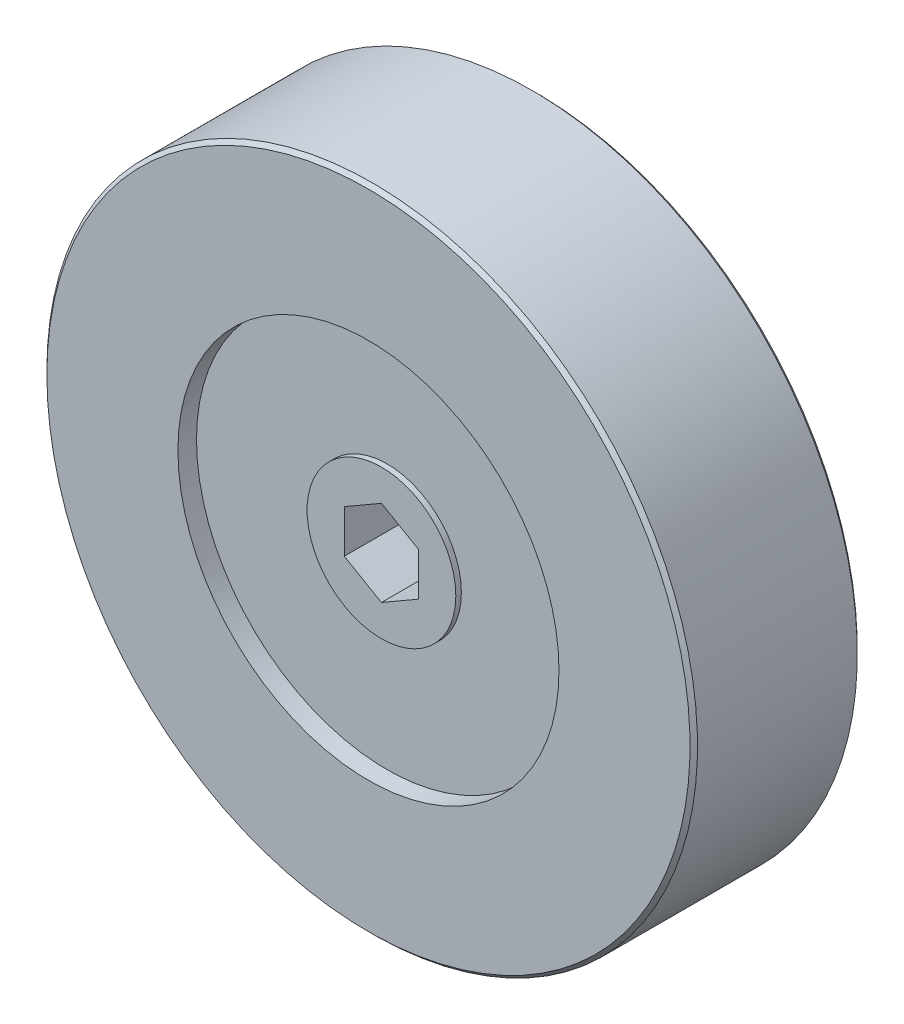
ISO-10303-21;
HEADER;
FILE_DESCRIPTION(('STEP AP214'),'2;1');
FILE_NAME('part.step','',(''),(''),'','','');
FILE_SCHEMA(('AUTOMOTIVE_DESIGN { 1 0 10303 214 1 1 1 1 }'));
ENDSEC;
DATA;
#1=APPLICATION_CONTEXT('core data for automotive mechanical design processes');
#2=APPLICATION_PROTOCOL_DEFINITION('international standard','automotive_design',2000,#1);
#3=PRODUCT_CONTEXT('',#1,'mechanical');
#4=PRODUCT('Part','Part','',(#3));
#5=PRODUCT_RELATED_PRODUCT_CATEGORY('part','',(#4));
#6=PRODUCT_DEFINITION_FORMATION('','',#4);
#7=PRODUCT_DEFINITION_CONTEXT('part definition',#1,'design');
#8=PRODUCT_DEFINITION('design','',#6,#7);
#9=PRODUCT_DEFINITION_SHAPE('','',#8);
#10=(LENGTH_UNIT() NAMED_UNIT(*) SI_UNIT(.MILLI.,.METRE.));
#11=(NAMED_UNIT(*) PLANE_ANGLE_UNIT() SI_UNIT($,.RADIAN.));
#12=(NAMED_UNIT(*) SI_UNIT($,.STERADIAN.) SOLID_ANGLE_UNIT());
#13=UNCERTAINTY_MEASURE_WITH_UNIT(LENGTH_MEASURE(1.E-05),#10,'distance_accuracy_value','');
#14=(GEOMETRIC_REPRESENTATION_CONTEXT(3) GLOBAL_UNCERTAINTY_ASSIGNED_CONTEXT((#13)) GLOBAL_UNIT_ASSIGNED_CONTEXT((#10,
#11,#12)) REPRESENTATION_CONTEXT('',''));
#15=CARTESIAN_POINT('',(0.,0.,0.));
#16=DIRECTION('',(0.,0.,1.));
#17=DIRECTION('',(1.,0.,0.));
#18=AXIS2_PLACEMENT_3D('',#15,#16,#17);
#19=CARTESIAN_POINT('',(0.,0.,1.2));
#20=DIRECTION('',(0.,0.,-1.));
#21=DIRECTION('',(-1.,0.,0.));
#22=AXIS2_PLACEMENT_3D('',#19,#20,#21);
#23=CYLINDRICAL_SURFACE('',#22,2.5);
#24=CARTESIAN_POINT('',(0.,0.,-7.1));
#25=DIRECTION('',(0.,0.,-1.));
#26=DIRECTION('',(-1.,0.,0.));
#27=AXIS2_PLACEMENT_3D('',#24,#25,#26);
#28=CIRCLE('',#27,2.5);
#29=CARTESIAN_POINT('',(-2.5,0.,-7.1));
#30=VERTEX_POINT('',#29);
#31=EDGE_CURVE('E9',#30,#30,#28,.F.);
#32=ORIENTED_EDGE('',*,*,#31,.T.);
#33=EDGE_LOOP('',(#32));
#34=FACE_BOUND('',#33,.T.);
#35=CARTESIAN_POINT('',(0.,0.,-1.1));
#36=DIRECTION('',(0.,0.,1.));
#37=DIRECTION('',(1.,0.,0.));
#38=AXIS2_PLACEMENT_3D('',#35,#36,#37);
#39=CIRCLE('',#38,2.5);
#40=CARTESIAN_POINT('',(2.5,0.,-1.1));
#41=VERTEX_POINT('',#40);
#42=EDGE_CURVE('E76',#41,#41,#39,.T.);
#43=ORIENTED_EDGE('',*,*,#42,.F.);
#44=EDGE_LOOP('',(#43));
#45=FACE_BOUND('',#44,.T.);
#46=ADVANCED_FACE('F14',(#34,#45),#23,.T.);
#47=CARTESIAN_POINT('',(0.,0.,1.2));
#48=DIRECTION('',(0.,0.,-1.));
#49=DIRECTION('',(-1.,0.,0.));
#50=AXIS2_PLACEMENT_3D('',#47,#48,#49);
#51=CYLINDRICAL_SURFACE('',#50,5.);
#52=CARTESIAN_POINT('',(0.,0.,2.));
#53=DIRECTION('',(0.,0.,-1.));
#54=DIRECTION('',(-1.,0.,0.));
#55=AXIS2_PLACEMENT_3D('',#52,#53,#54);
#56=CIRCLE('',#55,5.);
#57=CARTESIAN_POINT('',(-5.,0.,2.));
#58=VERTEX_POINT('',#57);
#59=EDGE_CURVE('E113',#58,#58,#56,.F.);
#60=ORIENTED_EDGE('',*,*,#59,.F.);
#61=EDGE_LOOP('',(#60));
#62=FACE_BOUND('',#61,.T.);
#63=CARTESIAN_POINT('',(0.,0.,0.5));
#64=DIRECTION('',(0.,0.,-1.));
#65=DIRECTION('',(-1.,0.,0.));
#66=AXIS2_PLACEMENT_3D('',#63,#64,#65);
#67=CIRCLE('',#66,5.);
#68=CARTESIAN_POINT('',(-5.,0.,0.5));
#69=VERTEX_POINT('',#68);
#70=EDGE_CURVE('E110',#69,#69,#67,.T.);
#71=ORIENTED_EDGE('',*,*,#70,.F.);
#72=EDGE_LOOP('',(#71));
#73=FACE_BOUND('',#72,.T.);
#74=ADVANCED_FACE('F155',(#62,#73),#51,.T.);
#75=CARTESIAN_POINT('',(0.,5.1,2.));
#76=DIRECTION('',(0.,0.,-1.));
#77=DIRECTION('',(-1.,0.,0.));
#78=AXIS2_PLACEMENT_3D('',#75,#76,#77);
#79=PLANE('',#78);
#80=CARTESIAN_POINT('',(0.,0.,2.));
#81=DIRECTION('',(0.,0.,1.));
#82=DIRECTION('',(1.,0.,0.));
#83=AXIS2_PLACEMENT_3D('',#80,#81,#82);
#84=CIRCLE('',#83,10.25);
#85=CARTESIAN_POINT('',(10.25,0.,2.));
#86=VERTEX_POINT('',#85);
#87=EDGE_CURVE('E128',#86,#86,#84,.T.);
#88=ORIENTED_EDGE('',*,*,#87,.F.);
#89=EDGE_LOOP('',(#88));
#90=FACE_BOUND('',#89,.T.);
#91=ORIENTED_EDGE('',*,*,#59,.T.);
#92=EDGE_LOOP('',(#91));
#93=FACE_BOUND('',#92,.T.);
#94=ADVANCED_FACE('F161',(#90,#93),#79,.T.);
#95=CARTESIAN_POINT('',(0.,0.,13.));
#96=DIRECTION('',(0.,0.,1.));
#97=DIRECTION('',(1.,0.,0.));
#98=AXIS2_PLACEMENT_3D('',#95,#96,#97);
#99=CYLINDRICAL_SURFACE('',#98,10.25);
#100=ORIENTED_EDGE('',*,*,#87,.T.);
#101=EDGE_LOOP('',(#100));
#102=FACE_BOUND('',#101,.T.);
#103=CARTESIAN_POINT('',(0.,0.,1.));
#104=DIRECTION('',(0.,0.,1.));
#105=DIRECTION('',(1.,0.,0.));
#106=AXIS2_PLACEMENT_3D('',#103,#104,#105);
#107=CIRCLE('',#106,10.25);
#108=CARTESIAN_POINT('',(10.25,0.,1.));
#109=VERTEX_POINT('',#108);
#110=EDGE_CURVE('E131',#109,#109,#107,.T.);
#111=ORIENTED_EDGE('',*,*,#110,.F.);
#112=EDGE_LOOP('',(#111));
#113=FACE_BOUND('',#112,.T.);
#114=ADVANCED_FACE('F196',(#102,#113),#99,.F.);
#115=CARTESIAN_POINT('',(0.,14.8,1.));
#116=DIRECTION('',(0.,0.,-1.));
#117=DIRECTION('',(-1.,0.,0.));
#118=AXIS2_PLACEMENT_3D('',#115,#116,#117);
#119=PLANE('',#118);
#120=CARTESIAN_POINT('',(0.,0.,1.));
#121=DIRECTION('',(0.,0.,-1.));
#122=DIRECTION('',(-1.,0.,0.));
#123=AXIS2_PLACEMENT_3D('',#120,#121,#122);
#124=CIRCLE('',#123,17.3);
#125=CARTESIAN_POINT('',(-17.3,0.,1.));
#126=VERTEX_POINT('',#125);
#127=EDGE_CURVE('E430',#126,#126,#124,.T.);
#128=ORIENTED_EDGE('',*,*,#127,.T.);
#129=EDGE_LOOP('',(#128));
#130=FACE_BOUND('',#129,.T.);
#131=ORIENTED_EDGE('',*,*,#110,.T.);
#132=EDGE_LOOP('',(#131));
#133=FACE_BOUND('',#132,.T.);
#134=ADVANCED_FACE('F200',(#130,#133),#119,.T.);
#135=CARTESIAN_POINT('',(0.,0.,0.5));
#136=DIRECTION('',(0.,0.,-1.));
#137=DIRECTION('',(-1.,0.,0.));
#138=AXIS2_PLACEMENT_3D('',#135,#136,#137);
#139=PLANE('',#138);
#140=CARTESIAN_POINT('',(0.,0.,0.5));
#141=DIRECTION('',(0.,0.,-1.));
#142=DIRECTION('',(-1.,0.,0.));
#143=AXIS2_PLACEMENT_3D('',#140,#141,#142);
#144=CIRCLE('',#143,2.);
#145=CARTESIAN_POINT('',(-2.,0.,0.5));
#146=VERTEX_POINT('',#145);
#147=EDGE_CURVE('E107',#146,#146,#144,.T.);
#148=ORIENTED_EDGE('',*,*,#147,.F.);
#149=EDGE_LOOP('',(#148));
#150=FACE_BOUND('',#149,.T.);
#151=ORIENTED_EDGE('',*,*,#70,.T.);
#152=EDGE_LOOP('',(#151));
#153=FACE_BOUND('',#152,.T.);
#154=ADVANCED_FACE('F170',(#150,#153),#139,.T.);
#155=CARTESIAN_POINT('',(0.,0.,1.2));
#156=DIRECTION('',(0.,0.,-1.));
#157=DIRECTION('',(-1.,0.,0.));
#158=AXIS2_PLACEMENT_3D('',#155,#156,#157);
#159=CYLINDRICAL_SURFACE('',#158,2.);
#160=CARTESIAN_POINT('',(0.,0.,-1.1));
#161=DIRECTION('',(0.,0.,1.));
#162=DIRECTION('',(1.,0.,0.));
#163=AXIS2_PLACEMENT_3D('',#160,#161,#162);
#164=CIRCLE('',#163,2.);
#165=CARTESIAN_POINT('',(2.,0.,-1.1));
#166=VERTEX_POINT('',#165);
#167=EDGE_CURVE('E106',#166,#166,#164,.T.);
#168=ORIENTED_EDGE('',*,*,#167,.T.);
#169=EDGE_LOOP('',(#168));
#170=FACE_BOUND('',#169,.T.);
#171=ORIENTED_EDGE('',*,*,#147,.T.);
#172=EDGE_LOOP('',(#171));
#173=FACE_BOUND('',#172,.T.);
#174=ADVANCED_FACE('F167',(#170,#173),#159,.T.);
#175=CARTESIAN_POINT('',(0.,0.,-1.1));
#176=DIRECTION('',(0.,0.,1.));
#177=DIRECTION('',(1.,0.,0.));
#178=AXIS2_PLACEMENT_3D('',#175,#176,#177);
#179=PLANE('',#178);
#180=ORIENTED_EDGE('',*,*,#167,.F.);
#181=EDGE_LOOP('',(#180));
#182=FACE_BOUND('',#181,.T.);
#183=ORIENTED_EDGE('',*,*,#42,.T.);
#184=EDGE_LOOP('',(#183));
#185=FACE_BOUND('',#184,.T.);
#186=ADVANCED_FACE('F151',(#182,#185),#179,.T.);
#187=CARTESIAN_POINT('',(0.,0.,-7.5));
#188=DIRECTION('',(0.,0.,-1.));
#189=DIRECTION('',(-1.,0.,0.));
#190=AXIS2_PLACEMENT_3D('',#187,#188,#189);
#191=PLANE('',#190);
#192=CARTESIAN_POINT('',(0.,0.,-7.5));
#193=DIRECTION('',(0.,0.,-1.));
#194=DIRECTION('',(-1.,0.,0.));
#195=AXIS2_PLACEMENT_3D('',#192,#193,#194);
#196=CIRCLE('',#195,2.1);
#197=CARTESIAN_POINT('',(-2.1,0.,-7.5));
#198=VERTEX_POINT('',#197);
#199=EDGE_CURVE('E22',#198,#198,#196,.T.);
#200=ORIENTED_EDGE('',*,*,#199,.T.);
#201=EDGE_LOOP('',(#200));
#202=FACE_BOUND('',#201,.T.);
#203=ADVANCED_FACE('F138',(#202),#191,.T.);
#204=CARTESIAN_POINT('',(0.,0.,-7.5));
#205=DIRECTION('',(0.,0.,1.));
#206=DIRECTION('',(1.,0.,0.));
#207=AXIS2_PLACEMENT_3D('',#204,#205,#206);
#208=CONICAL_SURFACE('',#207,2.1,0.785398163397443);
#209=ORIENTED_EDGE('',*,*,#31,.F.);
#210=EDGE_LOOP('',(#209));
#211=FACE_BOUND('',#210,.T.);
#212=ORIENTED_EDGE('',*,*,#199,.F.);
#213=EDGE_LOOP('',(#212));
#214=FACE_BOUND('',#213,.T.);
#215=ADVANCED_FACE('F16',(#211,#214),#208,.T.);
#216=CARTESIAN_POINT('',(0.,0.,9.79999999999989));
#217=DIRECTION('',(0.,0.,-1.));
#218=DIRECTION('',(-1.,0.,0.));
#219=AXIS2_PLACEMENT_3D('',#216,#217,#218);
#220=CONICAL_SURFACE('',#219,17.5,0.785398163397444);
#221=CARTESIAN_POINT('',(0.,0.,9.99999999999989));
#222=DIRECTION('',(0.,0.,-1.));
#223=DIRECTION('',(-1.,0.,0.));
#224=AXIS2_PLACEMENT_3D('',#221,#222,#223);
#225=CIRCLE('',#224,17.3);
#226=CARTESIAN_POINT('',(-17.3,0.,9.99999999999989));
#227=VERTEX_POINT('',#226);
#228=EDGE_CURVE('E86',#227,#227,#225,.T.);
#229=ORIENTED_EDGE('',*,*,#228,.T.);
#230=EDGE_LOOP('',(#229));
#231=FACE_BOUND('',#230,.T.);
#232=CARTESIAN_POINT('',(0.,0.,9.79999999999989));
#233=DIRECTION('',(0.,0.,-1.));
#234=DIRECTION('',(-1.,0.,0.));
#235=AXIS2_PLACEMENT_3D('',#232,#233,#234);
#236=CIRCLE('',#235,17.5);
#237=CARTESIAN_POINT('',(-17.5,0.,9.79999999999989));
#238=VERTEX_POINT('',#237);
#239=EDGE_CURVE('E212',#238,#238,#236,.T.);
#240=ORIENTED_EDGE('',*,*,#239,.F.);
#241=EDGE_LOOP('',(#240));
#242=FACE_BOUND('',#241,.T.);
#243=ADVANCED_FACE('F141',(#231,#242),#220,.T.);
#244=CARTESIAN_POINT('',(0.,0.,1.2));
#245=DIRECTION('',(0.,0.,-1.));
#246=DIRECTION('',(-1.,0.,0.));
#247=AXIS2_PLACEMENT_3D('',#244,#245,#246);
#248=CYLINDRICAL_SURFACE('',#247,17.5);
#249=ORIENTED_EDGE('',*,*,#239,.T.);
#250=EDGE_LOOP('',(#249));
#251=FACE_BOUND('',#250,.T.);
#252=CARTESIAN_POINT('',(0.,0.,1.2));
#253=DIRECTION('',(0.,0.,-1.));
#254=DIRECTION('',(-1.,0.,0.));
#255=AXIS2_PLACEMENT_3D('',#252,#253,#254);
#256=CIRCLE('',#255,17.5);
#257=CARTESIAN_POINT('',(-17.5,0.,1.2));
#258=VERTEX_POINT('',#257);
#259=EDGE_CURVE('E215',#258,#258,#256,.T.);
#260=ORIENTED_EDGE('',*,*,#259,.F.);
#261=EDGE_LOOP('',(#260));
#262=FACE_BOUND('',#261,.T.);
#263=ADVANCED_FACE('F148',(#251,#262),#248,.T.);
#264=CARTESIAN_POINT('',(0.,0.,1.));
#265=DIRECTION('',(0.,0.,1.));
#266=DIRECTION('',(1.,0.,0.));
#267=AXIS2_PLACEMENT_3D('',#264,#265,#266);
#268=CONICAL_SURFACE('',#267,17.3,0.785398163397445);
#269=ORIENTED_EDGE('',*,*,#259,.T.);
#270=EDGE_LOOP('',(#269));
#271=FACE_BOUND('',#270,.T.);
#272=ORIENTED_EDGE('',*,*,#127,.F.);
#273=EDGE_LOOP('',(#272));
#274=FACE_BOUND('',#273,.T.);
#275=ADVANCED_FACE('F176',(#271,#274),#268,.T.);
#276=CARTESIAN_POINT('',(0.,0.,5.8));
#277=DIRECTION('',(0.,0.,1.));
#278=DIRECTION('',(1.,0.,0.));
#279=AXIS2_PLACEMENT_3D('',#276,#277,#278);
#280=PLANE('',#279);
#281=DIRECTION('',(0.,-1.,0.));
#282=VECTOR('',#281,1.);
#283=CARTESIAN_POINT('',(-2.,1.15470053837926,5.8));
#284=LINE('',#283,#282);
#285=CARTESIAN_POINT('',(-2.,1.15470053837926,5.8));
#286=VERTEX_POINT('',#285);
#287=CARTESIAN_POINT('',(-2.,-1.15470053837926,5.8));
#288=VERTEX_POINT('',#287);
#289=EDGE_CURVE('E89',#286,#288,#284,.T.);
#290=ORIENTED_EDGE('',*,*,#289,.T.);
#291=DIRECTION('',(0.866025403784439,-0.5,0.));
#292=VECTOR('',#291,1.);
#293=CARTESIAN_POINT('',(-2.,-1.15470053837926,5.8));
#294=LINE('',#293,#292);
#295=CARTESIAN_POINT('',(0.,-2.30940107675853,5.8));
#296=VERTEX_POINT('',#295);
#297=EDGE_CURVE('E227',#288,#296,#294,.T.);
#298=ORIENTED_EDGE('',*,*,#297,.T.);
#299=DIRECTION('',(0.866025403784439,0.5,0.));
#300=VECTOR('',#299,1.);
#301=CARTESIAN_POINT('',(0.,-2.30940107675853,5.8));
#302=LINE('',#301,#300);
#303=CARTESIAN_POINT('',(2.,-1.15470053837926,5.8));
#304=VERTEX_POINT('',#303);
#305=EDGE_CURVE('E229',#296,#304,#302,.T.);
#306=ORIENTED_EDGE('',*,*,#305,.T.);
#307=DIRECTION('',(0.,1.,0.));
#308=VECTOR('',#307,1.);
#309=CARTESIAN_POINT('',(2.,-1.15470053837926,5.8));
#310=LINE('',#309,#308);
#311=CARTESIAN_POINT('',(2.,1.15470053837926,5.8));
#312=VERTEX_POINT('',#311);
#313=EDGE_CURVE('E231',#304,#312,#310,.T.);
#314=ORIENTED_EDGE('',*,*,#313,.T.);
#315=DIRECTION('',(-0.866025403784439,0.5,0.));
#316=VECTOR('',#315,1.);
#317=CARTESIAN_POINT('',(2.,1.15470053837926,5.8));
#318=LINE('',#317,#316);
#319=CARTESIAN_POINT('',(0.,2.30940107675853,5.8));
#320=VERTEX_POINT('',#319);
#321=EDGE_CURVE('E34',#312,#320,#318,.T.);
#322=ORIENTED_EDGE('',*,*,#321,.T.);
#323=DIRECTION('',(-0.866025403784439,-0.5,0.));
#324=VECTOR('',#323,1.);
#325=CARTESIAN_POINT('',(0.,2.30940107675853,5.8));
#326=LINE('',#325,#324);
#327=EDGE_CURVE('E29',#320,#286,#326,.T.);
#328=ORIENTED_EDGE('',*,*,#327,.T.);
#329=EDGE_LOOP('',(#290,#298,#306,#314,#322,#328));
#330=FACE_BOUND('',#329,.T.);
#331=ADVANCED_FACE('F172',(#330),#280,.T.);
#332=CARTESIAN_POINT('',(0.,-2.30940107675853,16.9376261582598));
#333=DIRECTION('',(-0.5,0.866025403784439,0.));
#334=DIRECTION('',(-0.866025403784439,-0.5,0.));
#335=AXIS2_PLACEMENT_3D('',#332,#333,#334);
#336=PLANE('',#335);
#337=DIRECTION('',(0.,0.,-1.));
#338=VECTOR('',#337,1.);
#339=CARTESIAN_POINT('',(0.,-2.30940107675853,16.9376261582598));
#340=LINE('',#339,#338);
#341=CARTESIAN_POINT('',(0.,-2.30940107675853,9.3));
#342=VERTEX_POINT('',#341);
#343=EDGE_CURVE('E77',#342,#296,#340,.T.);
#344=ORIENTED_EDGE('',*,*,#343,.F.);
#345=DIRECTION('',(0.866025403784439,0.5,0.));
#346=VECTOR('',#345,1.);
#347=CARTESIAN_POINT('',(0.,-2.30940107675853,9.3));
#348=LINE('',#347,#346);
#349=CARTESIAN_POINT('',(2.,-1.15470053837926,9.3));
#350=VERTEX_POINT('',#349);
#351=EDGE_CURVE('E223',#342,#350,#348,.T.);
#352=ORIENTED_EDGE('',*,*,#351,.T.);
#353=DIRECTION('',(0.,0.,-1.));
#354=VECTOR('',#353,1.);
#355=CARTESIAN_POINT('',(2.,-1.15470053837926,16.9376261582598));
#356=LINE('',#355,#354);
#357=EDGE_CURVE('E99',#350,#304,#356,.T.);
#358=ORIENTED_EDGE('',*,*,#357,.T.);
#359=ORIENTED_EDGE('',*,*,#305,.F.);
#360=EDGE_LOOP('',(#344,#352,#358,#359));
#361=FACE_BOUND('',#360,.T.);
#362=ADVANCED_FACE('F175',(#361),#336,.T.);
#363=CARTESIAN_POINT('',(2.,-1.15470053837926,16.9376261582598));
#364=DIRECTION('',(-1.,0.,0.));
#365=DIRECTION('',(0.,-1.,0.));
#366=AXIS2_PLACEMENT_3D('',#363,#364,#365);
#367=PLANE('',#366);
#368=ORIENTED_EDGE('',*,*,#357,.F.);
#369=DIRECTION('',(0.,1.,0.));
#370=VECTOR('',#369,1.);
#371=CARTESIAN_POINT('',(2.,-1.15470053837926,9.3));
#372=LINE('',#371,#370);
#373=CARTESIAN_POINT('',(2.,1.15470053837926,9.3));
#374=VERTEX_POINT('',#373);
#375=EDGE_CURVE('E220',#350,#374,#372,.T.);
#376=ORIENTED_EDGE('',*,*,#375,.T.);
#377=DIRECTION('',(0.,0.,-1.));
#378=VECTOR('',#377,1.);
#379=CARTESIAN_POINT('',(2.,1.15470053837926,16.9376261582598));
#380=LINE('',#379,#378);
#381=EDGE_CURVE('E92',#374,#312,#380,.T.);
#382=ORIENTED_EDGE('',*,*,#381,.T.);
#383=ORIENTED_EDGE('',*,*,#313,.F.);
#384=EDGE_LOOP('',(#368,#376,#382,#383));
#385=FACE_BOUND('',#384,.T.);
#386=ADVANCED_FACE('F243',(#385),#367,.T.);
#387=CARTESIAN_POINT('',(2.,1.15470053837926,16.9376261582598));
#388=DIRECTION('',(-0.5,-0.866025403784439,0.));
#389=DIRECTION('',(0.866025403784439,-0.5,0.));
#390=AXIS2_PLACEMENT_3D('',#387,#388,#389);
#391=PLANE('',#390);
#392=ORIENTED_EDGE('',*,*,#381,.F.);
#393=DIRECTION('',(-0.866025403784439,0.5,0.));
#394=VECTOR('',#393,1.);
#395=CARTESIAN_POINT('',(2.,1.15470053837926,9.3));
#396=LINE('',#395,#394);
#397=CARTESIAN_POINT('',(0.,2.30940107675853,9.3));
#398=VERTEX_POINT('',#397);
#399=EDGE_CURVE('E85',#374,#398,#396,.T.);
#400=ORIENTED_EDGE('',*,*,#399,.T.);
#401=DIRECTION('',(0.,0.,-1.));
#402=VECTOR('',#401,1.);
#403=CARTESIAN_POINT('',(0.,2.30940107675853,16.9376261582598));
#404=LINE('',#403,#402);
#405=EDGE_CURVE('E83',#398,#320,#404,.T.);
#406=ORIENTED_EDGE('',*,*,#405,.T.);
#407=ORIENTED_EDGE('',*,*,#321,.F.);
#408=EDGE_LOOP('',(#392,#400,#406,#407));
#409=FACE_BOUND('',#408,.T.);
#410=ADVANCED_FACE('F245',(#409),#391,.T.);
#411=CARTESIAN_POINT('',(0.,2.30940107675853,16.9376261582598));
#412=DIRECTION('',(0.5,-0.866025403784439,0.));
#413=DIRECTION('',(0.866025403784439,0.5,0.));
#414=AXIS2_PLACEMENT_3D('',#411,#412,#413);
#415=PLANE('',#414);
#416=ORIENTED_EDGE('',*,*,#405,.F.);
#417=DIRECTION('',(-0.866025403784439,-0.5,0.));
#418=VECTOR('',#417,1.);
#419=CARTESIAN_POINT('',(0.,2.30940107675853,9.3));
#420=LINE('',#419,#418);
#421=CARTESIAN_POINT('',(-2.,1.15470053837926,9.3));
#422=VERTEX_POINT('',#421);
#423=EDGE_CURVE('E68',#398,#422,#420,.T.);
#424=ORIENTED_EDGE('',*,*,#423,.T.);
#425=DIRECTION('',(0.,0.,-1.));
#426=VECTOR('',#425,1.);
#427=CARTESIAN_POINT('',(-2.,1.15470053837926,16.9376261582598));
#428=LINE('',#427,#426);
#429=EDGE_CURVE('E81',#422,#286,#428,.T.);
#430=ORIENTED_EDGE('',*,*,#429,.T.);
#431=ORIENTED_EDGE('',*,*,#327,.F.);
#432=EDGE_LOOP('',(#416,#424,#430,#431));
#433=FACE_BOUND('',#432,.T.);
#434=ADVANCED_FACE('F80',(#433),#415,.T.);
#435=CARTESIAN_POINT('',(-2.,1.15470053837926,16.9376261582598));
#436=DIRECTION('',(1.,0.,0.));
#437=DIRECTION('',(0.,0.,-1.));
#438=AXIS2_PLACEMENT_3D('',#435,#436,#437);
#439=PLANE('',#438);
#440=ORIENTED_EDGE('',*,*,#429,.F.);
#441=DIRECTION('',(0.,-1.,0.));
#442=VECTOR('',#441,1.);
#443=CARTESIAN_POINT('',(-2.,1.15470053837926,9.3));
#444=LINE('',#443,#442);
#445=CARTESIAN_POINT('',(-2.,-1.15470053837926,9.3));
#446=VERTEX_POINT('',#445);
#447=EDGE_CURVE('E65',#422,#446,#444,.T.);
#448=ORIENTED_EDGE('',*,*,#447,.T.);
#449=DIRECTION('',(0.,0.,-1.));
#450=VECTOR('',#449,1.);
#451=CARTESIAN_POINT('',(-2.,-1.15470053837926,16.9376261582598));
#452=LINE('',#451,#450);
#453=EDGE_CURVE('E90',#446,#288,#452,.T.);
#454=ORIENTED_EDGE('',*,*,#453,.T.);
#455=ORIENTED_EDGE('',*,*,#289,.F.);
#456=EDGE_LOOP('',(#440,#448,#454,#455));
#457=FACE_BOUND('',#456,.T.);
#458=ADVANCED_FACE('F88',(#457),#439,.T.);
#459=CARTESIAN_POINT('',(-2.,-1.15470053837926,16.9376261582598));
#460=DIRECTION('',(0.5,0.866025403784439,0.));
#461=DIRECTION('',(-0.866025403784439,0.5,0.));
#462=AXIS2_PLACEMENT_3D('',#459,#460,#461);
#463=PLANE('',#462);
#464=ORIENTED_EDGE('',*,*,#453,.F.);
#465=DIRECTION('',(0.866025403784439,-0.5,0.));
#466=VECTOR('',#465,1.);
#467=CARTESIAN_POINT('',(-2.,-1.15470053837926,9.3));
#468=LINE('',#467,#466);
#469=EDGE_CURVE('E71',#446,#342,#468,.T.);
#470=ORIENTED_EDGE('',*,*,#469,.T.);
#471=ORIENTED_EDGE('',*,*,#343,.T.);
#472=ORIENTED_EDGE('',*,*,#297,.F.);
#473=EDGE_LOOP('',(#464,#470,#471,#472));
#474=FACE_BOUND('',#473,.T.);
#475=ADVANCED_FACE('F192',(#474),#463,.T.);
#476=CARTESIAN_POINT('',(0.,4.00000000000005,9.3));
#477=DIRECTION('',(0.,0.,1.));
#478=DIRECTION('',(1.,0.,0.));
#479=AXIS2_PLACEMENT_3D('',#476,#477,#478);
#480=PLANE('',#479);
#481=CARTESIAN_POINT('',(0.,0.,9.3));
#482=DIRECTION('',(0.,0.,1.));
#483=DIRECTION('',(1.,0.,0.));
#484=AXIS2_PLACEMENT_3D('',#481,#482,#483);
#485=CIRCLE('',#484,4.00000000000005);
#486=CARTESIAN_POINT('',(4.00000000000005,0.,9.3));
#487=VERTEX_POINT('',#486);
#488=EDGE_CURVE('E125',#487,#487,#485,.T.);
#489=ORIENTED_EDGE('',*,*,#488,.T.);
#490=EDGE_LOOP('',(#489));
#491=FACE_BOUND('',#490,.T.);
#492=ORIENTED_EDGE('',*,*,#469,.F.);
#493=ORIENTED_EDGE('',*,*,#447,.F.);
#494=ORIENTED_EDGE('',*,*,#423,.F.);
#495=ORIENTED_EDGE('',*,*,#399,.F.);
#496=ORIENTED_EDGE('',*,*,#375,.F.);
#497=ORIENTED_EDGE('',*,*,#351,.F.);
#498=EDGE_LOOP('',(#492,#493,#494,#495,#496,#497));
#499=FACE_BOUND('',#498,.T.);
#500=ADVANCED_FACE('F67',(#491,#499),#480,.T.);
#501=CARTESIAN_POINT('',(0.,0.,13.));
#502=DIRECTION('',(0.,0.,1.));
#503=DIRECTION('',(1.,0.,0.));
#504=AXIS2_PLACEMENT_3D('',#501,#502,#503);
#505=CYLINDRICAL_SURFACE('',#504,4.00000000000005);
#506=CARTESIAN_POINT('',(0.,0.,9.));
#507=DIRECTION('',(0.,0.,1.));
#508=DIRECTION('',(1.,0.,0.));
#509=AXIS2_PLACEMENT_3D('',#506,#507,#508);
#510=CIRCLE('',#509,4.00000000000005);
#511=CARTESIAN_POINT('',(4.00000000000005,0.,9.));
#512=VERTEX_POINT('',#511);
#513=EDGE_CURVE('E122',#512,#512,#510,.T.);
#514=ORIENTED_EDGE('',*,*,#513,.T.);
#515=EDGE_LOOP('',(#514));
#516=FACE_BOUND('',#515,.T.);
#517=ORIENTED_EDGE('',*,*,#488,.F.);
#518=EDGE_LOOP('',(#517));
#519=FACE_BOUND('',#518,.T.);
#520=ADVANCED_FACE('F185',(#516,#519),#505,.T.);
#521=CARTESIAN_POINT('',(0.,10.25,9.));
#522=DIRECTION('',(0.,0.,1.));
#523=DIRECTION('',(1.,0.,0.));
#524=AXIS2_PLACEMENT_3D('',#521,#522,#523);
#525=PLANE('',#524);
#526=CARTESIAN_POINT('',(0.,0.,9.));
#527=DIRECTION('',(0.,0.,1.));
#528=DIRECTION('',(1.,0.,0.));
#529=AXIS2_PLACEMENT_3D('',#526,#527,#528);
#530=CIRCLE('',#529,10.25);
#531=CARTESIAN_POINT('',(10.25,0.,9.));
#532=VERTEX_POINT('',#531);
#533=EDGE_CURVE('E119',#532,#532,#530,.T.);
#534=ORIENTED_EDGE('',*,*,#533,.T.);
#535=EDGE_LOOP('',(#534));
#536=FACE_BOUND('',#535,.T.);
#537=ORIENTED_EDGE('',*,*,#513,.F.);
#538=EDGE_LOOP('',(#537));
#539=FACE_BOUND('',#538,.T.);
#540=ADVANCED_FACE('F181',(#536,#539),#525,.T.);
#541=CARTESIAN_POINT('',(0.,0.,13.));
#542=DIRECTION('',(0.,0.,1.));
#543=DIRECTION('',(1.,0.,0.));
#544=AXIS2_PLACEMENT_3D('',#541,#542,#543);
#545=CYLINDRICAL_SURFACE('',#544,10.25);
#546=CARTESIAN_POINT('',(0.,0.,10.));
#547=DIRECTION('',(0.,0.,1.));
#548=DIRECTION('',(1.,0.,0.));
#549=AXIS2_PLACEMENT_3D('',#546,#547,#548);
#550=CIRCLE('',#549,10.25);
#551=CARTESIAN_POINT('',(10.25,0.,10.));
#552=VERTEX_POINT('',#551);
#553=EDGE_CURVE('E116',#552,#552,#550,.T.);
#554=ORIENTED_EDGE('',*,*,#553,.T.);
#555=EDGE_LOOP('',(#554));
#556=FACE_BOUND('',#555,.T.);
#557=ORIENTED_EDGE('',*,*,#533,.F.);
#558=EDGE_LOOP('',(#557));
#559=FACE_BOUND('',#558,.T.);
#560=ADVANCED_FACE('F177',(#556,#559),#545,.F.);
#561=CARTESIAN_POINT('',(0.,14.8,10.));
#562=DIRECTION('',(0.,0.,1.));
#563=DIRECTION('',(1.,0.,0.));
#564=AXIS2_PLACEMENT_3D('',#561,#562,#563);
#565=PLANE('',#564);
#566=ORIENTED_EDGE('',*,*,#553,.F.);
#567=EDGE_LOOP('',(#566));
#568=FACE_BOUND('',#567,.T.);
#569=ORIENTED_EDGE('',*,*,#228,.F.);
#570=EDGE_LOOP('',(#569));
#571=FACE_BOUND('',#570,.T.);
#572=ADVANCED_FACE('F180',(#568,#571),#565,.T.);
#573=CLOSED_SHELL('',(#46,#74,#94,#114,#134,#154,#174,#186,#203,#215,#243,#263,#275,#331,#362,
#386,#410,#434,#458,#475,#500,#520,#540,#560,#572));
#574=MANIFOLD_SOLID_BREP('B1',#573);
#575=ADVANCED_BREP_SHAPE_REPRESENTATION('',(#18,#574),#14);
#576=SHAPE_DEFINITION_REPRESENTATION(#9,#575);
ENDSEC;
END-ISO-10303-21;
